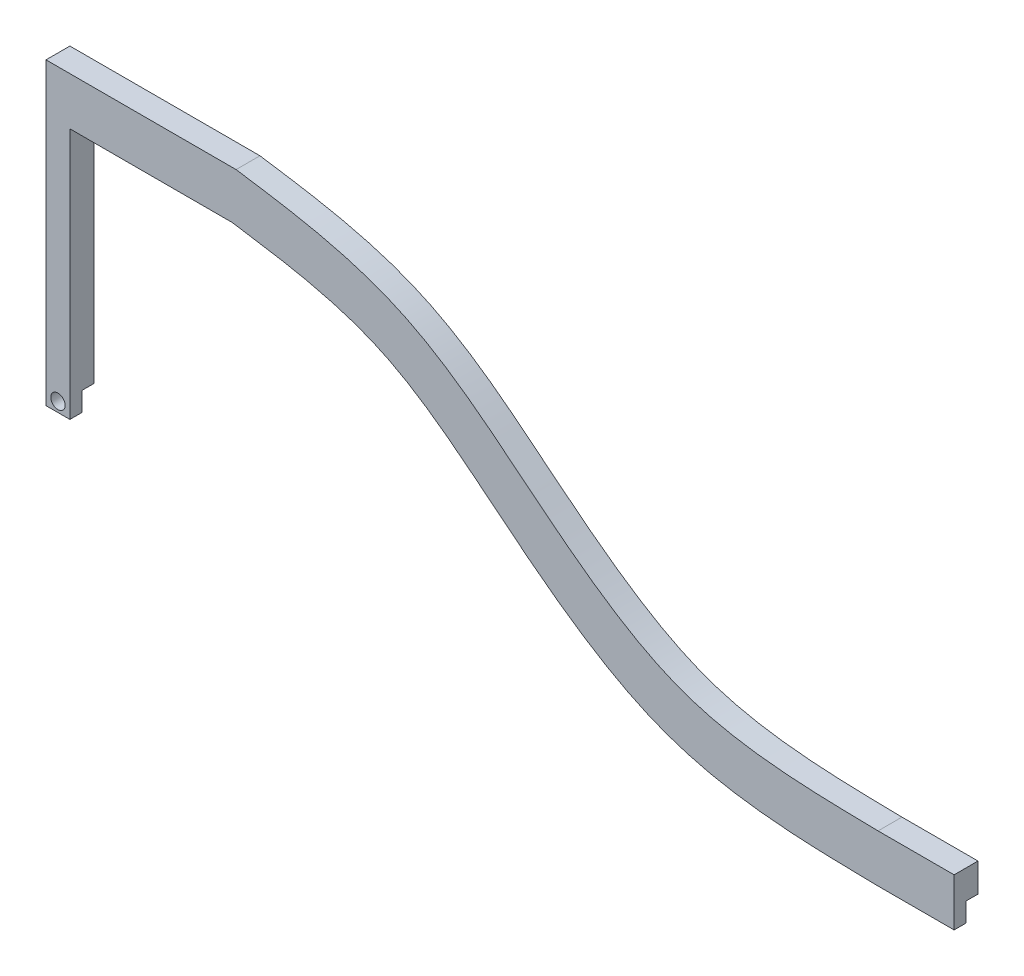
ISO-10303-21;
HEADER;
FILE_DESCRIPTION(('STEP AP214'),'2;1');
FILE_NAME('part.step','',(''),(''),'','','');
FILE_SCHEMA(('AUTOMOTIVE_DESIGN { 1 0 10303 214 1 1 1 1 }'));
ENDSEC;
DATA;
#1=APPLICATION_CONTEXT('core data for automotive mechanical design processes');
#2=APPLICATION_PROTOCOL_DEFINITION('international standard','automotive_design',2000,#1);
#3=PRODUCT_CONTEXT('',#1,'mechanical');
#4=PRODUCT('Part','Part','',(#3));
#5=PRODUCT_RELATED_PRODUCT_CATEGORY('part','',(#4));
#6=PRODUCT_DEFINITION_FORMATION('','',#4);
#7=PRODUCT_DEFINITION_CONTEXT('part definition',#1,'design');
#8=PRODUCT_DEFINITION('design','',#6,#7);
#9=PRODUCT_DEFINITION_SHAPE('','',#8);
#10=(LENGTH_UNIT() NAMED_UNIT(*) SI_UNIT(.MILLI.,.METRE.));
#11=(NAMED_UNIT(*) PLANE_ANGLE_UNIT() SI_UNIT($,.RADIAN.));
#12=(NAMED_UNIT(*) SI_UNIT($,.STERADIAN.) SOLID_ANGLE_UNIT());
#13=UNCERTAINTY_MEASURE_WITH_UNIT(LENGTH_MEASURE(1.E-05),#10,'distance_accuracy_value','');
#14=(GEOMETRIC_REPRESENTATION_CONTEXT(3) GLOBAL_UNCERTAINTY_ASSIGNED_CONTEXT((#13)) GLOBAL_UNIT_ASSIGNED_CONTEXT((#10,
#11,#12)) REPRESENTATION_CONTEXT('',''));
#15=CARTESIAN_POINT('',(0.,0.,0.));
#16=DIRECTION('',(0.,0.,1.));
#17=DIRECTION('',(1.,0.,0.));
#18=AXIS2_PLACEMENT_3D('',#15,#16,#17);
#19=CARTESIAN_POINT('',(0.,15.922114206,1.27));
#20=DIRECTION('',(0.,1.,0.));
#21=DIRECTION('',(0.,0.,1.));
#22=AXIS2_PLACEMENT_3D('',#19,#20,#21);
#23=PLANE('',#22);
#24=DIRECTION('',(1.,0.,0.));
#25=VECTOR('',#24,1.);
#26=CARTESIAN_POINT('',(0.,15.922114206,0.));
#27=LINE('',#26,#25);
#28=CARTESIAN_POINT('',(-1.27,15.922114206,0.));
#29=VERTEX_POINT('',#28);
#30=CARTESIAN_POINT('',(8.83455771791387,15.922114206,0.));
#31=VERTEX_POINT('',#30);
#32=EDGE_CURVE('E224',#29,#31,#27,.T.);
#33=ORIENTED_EDGE('',*,*,#32,.F.);
#34=DIRECTION('',(0.,0.,-1.));
#35=VECTOR('',#34,1.);
#36=CARTESIAN_POINT('',(-1.27,15.922114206,67.9279261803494));
#37=LINE('',#36,#35);
#38=CARTESIAN_POINT('',(-1.27,15.922114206,1.26999999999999));
#39=VERTEX_POINT('',#38);
#40=EDGE_CURVE('E171',#39,#29,#37,.T.);
#41=ORIENTED_EDGE('',*,*,#40,.F.);
#42=DIRECTION('',(1.,0.,0.));
#43=VECTOR('',#42,1.);
#44=CARTESIAN_POINT('',(0.,15.922114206,1.27));
#45=LINE('',#44,#43);
#46=CARTESIAN_POINT('',(8.83455771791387,15.922114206,1.27));
#47=VERTEX_POINT('',#46);
#48=EDGE_CURVE('E192',#39,#47,#45,.T.);
#49=ORIENTED_EDGE('',*,*,#48,.T.);
#50=DIRECTION('',(0.,0.,-1.));
#51=VECTOR('',#50,1.);
#52=CARTESIAN_POINT('',(8.83455771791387,15.922114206,1.27));
#53=LINE('',#52,#51);
#54=EDGE_CURVE('E227',#47,#31,#53,.T.);
#55=ORIENTED_EDGE('',*,*,#54,.T.);
#56=EDGE_LOOP('',(#33,#41,#49,#55));
#57=FACE_BOUND('',#56,.T.);
#58=ADVANCED_FACE('F31',(#57),#23,.T.);
#59=CARTESIAN_POINT('',(0.,0.,1.27));
#60=DIRECTION('',(0.,-1.,0.));
#61=DIRECTION('',(0.,0.,-1.));
#62=AXIS2_PLACEMENT_3D('',#59,#60,#61);
#63=PLANE('',#62);
#64=DIRECTION('',(-1.,0.,0.));
#65=VECTOR('',#64,1.);
#66=CARTESIAN_POINT('',(65.1488690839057,0.,0.635));
#67=LINE('',#66,#65);
#68=CARTESIAN_POINT('',(0.,0.,0.635));
#69=VERTEX_POINT('',#68);
#70=CARTESIAN_POINT('',(-1.27,0.,0.634999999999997));
#71=VERTEX_POINT('',#70);
#72=EDGE_CURVE('E54',#69,#71,#67,.T.);
#73=ORIENTED_EDGE('',*,*,#72,.F.);
#74=DIRECTION('',(0.,0.,-1.));
#75=VECTOR('',#74,1.);
#76=CARTESIAN_POINT('',(0.,0.,1.27));
#77=LINE('',#76,#75);
#78=CARTESIAN_POINT('',(0.,0.,1.27));
#79=VERTEX_POINT('',#78);
#80=EDGE_CURVE('E260',#79,#69,#77,.T.);
#81=ORIENTED_EDGE('',*,*,#80,.F.);
#82=DIRECTION('',(-1.,0.,0.));
#83=VECTOR('',#82,1.);
#84=CARTESIAN_POINT('',(0.,0.,1.27));
#85=LINE('',#84,#83);
#86=CARTESIAN_POINT('',(-1.27,0.,1.26999999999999));
#87=VERTEX_POINT('',#86);
#88=EDGE_CURVE('E337',#79,#87,#85,.T.);
#89=ORIENTED_EDGE('',*,*,#88,.T.);
#90=DIRECTION('',(0.,0.,-1.));
#91=VECTOR('',#90,1.);
#92=CARTESIAN_POINT('',(-1.27,0.,67.9279261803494));
#93=LINE('',#92,#91);
#94=EDGE_CURVE('E170',#87,#71,#93,.T.);
#95=ORIENTED_EDGE('',*,*,#94,.T.);
#96=EDGE_LOOP('',(#73,#81,#89,#95));
#97=FACE_BOUND('',#96,.T.);
#98=ADVANCED_FACE('F215',(#97),#63,.T.);
#99=CARTESIAN_POINT('',(26.7020393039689,7.21110102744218,1.27));
#100=DIRECTION('',(0.,0.,-1.));
#101=DIRECTION('',(-1.,0.,0.));
#102=AXIS2_PLACEMENT_3D('',#99,#100,#101);
#103=PLANE('',#102);
#104=CARTESIAN_POINT('',(-0.635,0.517047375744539,1.27));
#105=DIRECTION('',(0.,0.,1.));
#106=DIRECTION('',(1.,0.,0.));
#107=AXIS2_PLACEMENT_3D('',#104,#105,#106);
#108=CIRCLE('',#107,0.381);
#109=CARTESIAN_POINT('',(-0.254,0.517047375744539,1.27));
#110=VERTEX_POINT('',#109);
#111=EDGE_CURVE('E143',#110,#110,#108,.T.);
#112=ORIENTED_EDGE('',*,*,#111,.F.);
#113=EDGE_LOOP('',(#112));
#114=FACE_BOUND('',#113,.T.);
#115=DIRECTION('',(0.,1.,0.));
#116=VECTOR('',#115,1.);
#117=CARTESIAN_POINT('',(-1.27,7.21110102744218,1.27));
#118=LINE('',#117,#116);
#119=EDGE_CURVE('E174',#87,#39,#118,.T.);
#120=ORIENTED_EDGE('',*,*,#119,.F.);
#121=ORIENTED_EDGE('',*,*,#88,.F.);
#122=DIRECTION('',(0.,1.,0.));
#123=VECTOR('',#122,1.);
#124=CARTESIAN_POINT('',(0.,0.,1.27));
#125=LINE('',#124,#123);
#126=CARTESIAN_POINT('',(0.,13.382114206,1.27));
#127=VERTEX_POINT('',#126);
#128=EDGE_CURVE('E296',#79,#127,#125,.T.);
#129=ORIENTED_EDGE('',*,*,#128,.T.);
#130=DIRECTION('',(1.,0.,0.));
#131=VECTOR('',#130,1.);
#132=CARTESIAN_POINT('',(0.,13.382114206,1.27));
#133=LINE('',#132,#131);
#134=CARTESIAN_POINT('',(8.64245458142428,13.382114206,1.27));
#135=VERTEX_POINT('',#134);
#136=EDGE_CURVE('E293',#127,#135,#133,.T.);
#137=ORIENTED_EDGE('',*,*,#136,.T.);
#138=CARTESIAN_POINT('',(8.64245458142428,13.382114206,1.27));
#139=CARTESIAN_POINT('',(11.3837031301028,12.9650811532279,1.27));
#140=CARTESIAN_POINT('',(16.6168440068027,12.1689502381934,1.27));
#141=CARTESIAN_POINT('',(23.466093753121,6.44904374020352,1.27));
#142=CARTESIAN_POINT('',(31.478990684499,0.189830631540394,1.27));
#143=CARTESIAN_POINT('',(39.0643321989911,0.0642075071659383,1.27));
#144=CARTESIAN_POINT('',(42.9412925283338,0.,1.27));
#145=B_SPLINE_CURVE_WITH_KNOTS('',3,(#138,#139,#140,#141,#142,#143,#144),.UNSPECIFIED.,.F.,.F.,
(4,1,1,1,4),(0.,0.216097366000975,0.412537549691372,0.699740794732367,1.),.UNSPECIFIED.);
#146=CARTESIAN_POINT('',(42.9412925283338,0.,1.27));
#147=VERTEX_POINT('',#146);
#148=EDGE_CURVE('E254',#135,#147,#145,.T.);
#149=ORIENTED_EDGE('',*,*,#148,.T.);
#150=DIRECTION('',(1.,0.,0.));
#151=VECTOR('',#150,1.);
#152=CARTESIAN_POINT('',(42.9412925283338,0.,1.27));
#153=LINE('',#152,#151);
#154=CARTESIAN_POINT('',(47.0052925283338,0.,1.27));
#155=VERTEX_POINT('',#154);
#156=EDGE_CURVE('E178',#147,#155,#153,.T.);
#157=ORIENTED_EDGE('',*,*,#156,.T.);
#158=DIRECTION('',(0.,-1.,0.));
#159=VECTOR('',#158,1.);
#160=CARTESIAN_POINT('',(47.0052925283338,2.54,1.27));
#161=LINE('',#160,#159);
#162=CARTESIAN_POINT('',(47.0052925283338,2.54,1.27));
#163=VERTEX_POINT('',#162);
#164=EDGE_CURVE('E180',#163,#155,#161,.T.);
#165=ORIENTED_EDGE('',*,*,#164,.F.);
#166=DIRECTION('',(1.,0.,0.));
#167=VECTOR('',#166,1.);
#168=CARTESIAN_POINT('',(42.9412925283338,2.54,1.27));
#169=LINE('',#168,#167);
#170=CARTESIAN_POINT('',(42.9623243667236,2.54,1.27));
#171=VERTEX_POINT('',#170);
#172=EDGE_CURVE('E183',#171,#163,#169,.T.);
#173=ORIENTED_EDGE('',*,*,#172,.F.);
#174=CARTESIAN_POINT('',(8.83455771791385,15.922114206,1.27));
#175=CARTESIAN_POINT('',(9.23273478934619,15.8615385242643,1.27));
#176=CARTESIAN_POINT('',(9.63311586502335,15.8009005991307,1.27));
#177=CARTESIAN_POINT('',(10.4441054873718,15.6741757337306,1.27));
#178=CARTESIAN_POINT('',(10.8535402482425,15.6082191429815,1.27));
#179=CARTESIAN_POINT('',(12.0908968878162,15.3953394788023,1.27));
#180=CARTESIAN_POINT('',(12.9279317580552,15.2336201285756,1.27));
#181=CARTESIAN_POINT('',(14.6114985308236,14.8272292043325,1.27));
#182=CARTESIAN_POINT('',(15.4583285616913,14.5824900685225,1.27));
#183=CARTESIAN_POINT('',(16.7207698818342,14.115925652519,1.27));
#184=CARTESIAN_POINT('',(17.1402076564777,13.9437798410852,1.27));
#185=CARTESIAN_POINT('',(17.9724186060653,13.5599427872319,1.27));
#186=CARTESIAN_POINT('',(18.3764903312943,13.3519568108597,1.27));
#187=CARTESIAN_POINT('',(19.5491715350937,12.6952136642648,1.27));
#188=CARTESIAN_POINT('',(20.2815702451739,12.2126050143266,1.27));
#189=CARTESIAN_POINT('',(21.677061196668,11.2109690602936,1.27));
#190=CARTESIAN_POINT('',(22.3404330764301,10.6917151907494,1.27));
#191=CARTESIAN_POINT('',(23.6255901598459,9.65963581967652,1.27));
#192=CARTESIAN_POINT('',(24.2449733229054,9.14974524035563,1.27));
#193=CARTESIAN_POINT('',(25.4784794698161,8.1566812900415,1.27));
#194=CARTESIAN_POINT('',(26.0912160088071,7.67245835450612,1.27));
#195=CARTESIAN_POINT('',(27.9236858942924,6.28838637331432,1.27));
#196=CARTESIAN_POINT('',(29.1380165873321,5.45869430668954,1.27));
#197=CARTESIAN_POINT('',(30.9601431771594,4.46366236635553,1.27));
#198=CARTESIAN_POINT('',(31.5674093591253,4.17321837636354,1.27));
#199=CARTESIAN_POINT('',(32.481150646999,3.8087078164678,1.27));
#200=CARTESIAN_POINT('',(32.7851437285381,3.69964034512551,1.27));
#201=CARTESIAN_POINT('',(33.4102256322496,3.49948761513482,1.27));
#202=CARTESIAN_POINT('',(33.7295545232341,3.40886505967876,1.27));
#203=CARTESIAN_POINT('',(35.3598925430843,2.99892132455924,1.27));
#204=CARTESIAN_POINT('',(36.7742000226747,2.81059923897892,1.27));
#205=CARTESIAN_POINT('',(39.7660493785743,2.59467989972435,1.27));
#206=CARTESIAN_POINT('',(41.3415368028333,2.56684399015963,1.27));
#207=CARTESIAN_POINT('',(42.9623243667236,2.54,1.27));
#208=B_SPLINE_CURVE_WITH_KNOTS('',3,(#174,#175,#176,#177,#178,#179,#180,#181,#182,#183,#184,
#185,#186,#187,#188,#189,#190,#191,#192,#193,#194,#195,#196,#197,#198,#199,#200,#201,#202,#203,
#204,#205,#206,#207),.UNSPECIFIED.,.F.,.F.,(4,2,2,2,2,2,2,2,2,2,2,2,2,2,2,2,4),(0.,
0.0312499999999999,0.0624999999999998,0.125,0.1875,0.21875,0.25,0.3125,0.375,0.4375,0.5,0.625,
0.6875,0.71875,0.750000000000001,0.875,1.),.UNSPECIFIED.);
#209=EDGE_CURVE('E186',#47,#171,#208,.T.);
#210=ORIENTED_EDGE('',*,*,#209,.F.);
#211=ORIENTED_EDGE('',*,*,#48,.F.);
#212=EDGE_LOOP('',(#120,#121,#129,#137,#149,#157,#165,#173,#210,#211));
#213=FACE_BOUND('',#212,.T.);
#214=ADVANCED_FACE('F220',(#114,#213),#103,.F.);
#215=CARTESIAN_POINT('',(26.7020393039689,7.21110102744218,0.));
#216=DIRECTION('',(0.,0.,-1.));
#217=DIRECTION('',(-1.,0.,0.));
#218=AXIS2_PLACEMENT_3D('',#215,#216,#217);
#219=PLANE('',#218);
#220=DIRECTION('',(-1.,0.,0.));
#221=VECTOR('',#220,1.);
#222=CARTESIAN_POINT('',(65.1488690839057,1.016,0.));
#223=LINE('',#222,#221);
#224=CARTESIAN_POINT('',(0.,1.016,0.));
#225=VERTEX_POINT('',#224);
#226=CARTESIAN_POINT('',(-1.26999999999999,1.016,0.));
#227=VERTEX_POINT('',#226);
#228=EDGE_CURVE('E153',#225,#227,#223,.T.);
#229=ORIENTED_EDGE('',*,*,#228,.T.);
#230=DIRECTION('',(0.,1.,0.));
#231=VECTOR('',#230,1.);
#232=CARTESIAN_POINT('',(-1.27,7.21110102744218,0.));
#233=LINE('',#232,#231);
#234=EDGE_CURVE('E39',#227,#29,#233,.T.);
#235=ORIENTED_EDGE('',*,*,#234,.T.);
#236=ORIENTED_EDGE('',*,*,#32,.T.);
#237=CARTESIAN_POINT('',(8.83455771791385,15.922114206,0.));
#238=CARTESIAN_POINT('',(9.23273478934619,15.8615385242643,0.));
#239=CARTESIAN_POINT('',(9.63311586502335,15.8009005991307,0.));
#240=CARTESIAN_POINT('',(10.4441054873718,15.6741757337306,0.));
#241=CARTESIAN_POINT('',(10.8535402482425,15.6082191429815,0.));
#242=CARTESIAN_POINT('',(12.0908968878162,15.3953394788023,0.));
#243=CARTESIAN_POINT('',(12.9279317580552,15.2336201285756,0.));
#244=CARTESIAN_POINT('',(14.6114985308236,14.8272292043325,0.));
#245=CARTESIAN_POINT('',(15.4583285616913,14.5824900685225,0.));
#246=CARTESIAN_POINT('',(16.7207698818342,14.115925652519,0.));
#247=CARTESIAN_POINT('',(17.1402076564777,13.9437798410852,0.));
#248=CARTESIAN_POINT('',(17.9724186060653,13.5599427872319,0.));
#249=CARTESIAN_POINT('',(18.3764903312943,13.3519568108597,0.));
#250=CARTESIAN_POINT('',(19.5491715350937,12.6952136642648,0.));
#251=CARTESIAN_POINT('',(20.2815702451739,12.2126050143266,0.));
#252=CARTESIAN_POINT('',(21.677061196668,11.2109690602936,0.));
#253=CARTESIAN_POINT('',(22.3404330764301,10.6917151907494,0.));
#254=CARTESIAN_POINT('',(23.6255901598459,9.65963581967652,0.));
#255=CARTESIAN_POINT('',(24.2449733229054,9.14974524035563,0.));
#256=CARTESIAN_POINT('',(25.4784794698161,8.1566812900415,0.));
#257=CARTESIAN_POINT('',(26.0912160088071,7.67245835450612,0.));
#258=CARTESIAN_POINT('',(27.9236858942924,6.28838637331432,0.));
#259=CARTESIAN_POINT('',(29.1380165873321,5.45869430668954,0.));
#260=CARTESIAN_POINT('',(30.9601431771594,4.46366236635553,0.));
#261=CARTESIAN_POINT('',(31.5674093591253,4.17321837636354,0.));
#262=CARTESIAN_POINT('',(32.481150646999,3.8087078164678,0.));
#263=CARTESIAN_POINT('',(32.7851437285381,3.69964034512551,0.));
#264=CARTESIAN_POINT('',(33.4102256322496,3.49948761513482,0.));
#265=CARTESIAN_POINT('',(33.7295545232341,3.40886505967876,0.));
#266=CARTESIAN_POINT('',(35.3598925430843,2.99892132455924,0.));
#267=CARTESIAN_POINT('',(36.7742000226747,2.81059923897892,0.));
#268=CARTESIAN_POINT('',(39.7660493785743,2.59467989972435,0.));
#269=CARTESIAN_POINT('',(41.3415368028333,2.56684399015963,0.));
#270=CARTESIAN_POINT('',(42.9623243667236,2.54,0.));
#271=B_SPLINE_CURVE_WITH_KNOTS('',3,(#237,#238,#239,#240,#241,#242,#243,#244,#245,#246,#247,
#248,#249,#250,#251,#252,#253,#254,#255,#256,#257,#258,#259,#260,#261,#262,#263,#264,#265,#266,
#267,#268,#269,#270),.UNSPECIFIED.,.F.,.F.,(4,2,2,2,2,2,2,2,2,2,2,2,2,2,2,2,4),(0.,
0.0312499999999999,0.0624999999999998,0.125,0.1875,0.21875,0.25,0.3125,0.375,0.4375,0.5,0.625,
0.6875,0.71875,0.750000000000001,0.875,1.),.UNSPECIFIED.);
#272=CARTESIAN_POINT('',(42.9623243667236,2.54,0.));
#273=VERTEX_POINT('',#272);
#274=EDGE_CURVE('E232',#31,#273,#271,.T.);
#275=ORIENTED_EDGE('',*,*,#274,.T.);
#276=DIRECTION('',(1.,0.,0.));
#277=VECTOR('',#276,1.);
#278=CARTESIAN_POINT('',(42.9412925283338,2.54,0.));
#279=LINE('',#278,#277);
#280=CARTESIAN_POINT('',(47.0052925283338,2.54,0.));
#281=VERTEX_POINT('',#280);
#282=EDGE_CURVE('E236',#273,#281,#279,.T.);
#283=ORIENTED_EDGE('',*,*,#282,.T.);
#284=DIRECTION('',(0.,-1.,0.));
#285=VECTOR('',#284,1.);
#286=CARTESIAN_POINT('',(47.0052925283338,2.54,0.));
#287=LINE('',#286,#285);
#288=CARTESIAN_POINT('',(47.0052925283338,1.016,0.));
#289=VERTEX_POINT('',#288);
#290=EDGE_CURVE('E177',#281,#289,#287,.T.);
#291=ORIENTED_EDGE('',*,*,#290,.T.);
#292=CARTESIAN_POINT('',(32.867344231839,1.016,0.));
#293=VERTEX_POINT('',#292);
#294=EDGE_CURVE('E138',#289,#293,#223,.T.);
#295=ORIENTED_EDGE('',*,*,#294,.T.);
#296=CARTESIAN_POINT('',(8.64245458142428,13.382114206,0.));
#297=CARTESIAN_POINT('',(11.3837031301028,12.9650811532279,0.));
#298=CARTESIAN_POINT('',(16.6168440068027,12.1689502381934,0.));
#299=CARTESIAN_POINT('',(23.466093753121,6.44904374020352,0.));
#300=CARTESIAN_POINT('',(31.478990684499,0.189830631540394,0.));
#301=CARTESIAN_POINT('',(39.0643321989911,0.0642075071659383,0.));
#302=CARTESIAN_POINT('',(42.9412925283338,0.,0.));
#303=B_SPLINE_CURVE_WITH_KNOTS('',3,(#296,#297,#298,#299,#300,#301,#302),.UNSPECIFIED.,.F.,.F.,
(4,1,1,1,4),(0.,0.216097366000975,0.412537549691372,0.699740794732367,1.),.UNSPECIFIED.);
#304=CARTESIAN_POINT('',(8.64245458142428,13.382114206,0.));
#305=VERTEX_POINT('',#304);
#306=EDGE_CURVE('E181',#305,#293,#303,.T.);
#307=ORIENTED_EDGE('',*,*,#306,.F.);
#308=DIRECTION('',(1.,0.,0.));
#309=VECTOR('',#308,1.);
#310=CARTESIAN_POINT('',(0.,13.382114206,0.));
#311=LINE('',#310,#309);
#312=CARTESIAN_POINT('',(0.,13.382114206,0.));
#313=VERTEX_POINT('',#312);
#314=EDGE_CURVE('E234',#313,#305,#311,.T.);
#315=ORIENTED_EDGE('',*,*,#314,.F.);
#316=DIRECTION('',(0.,1.,0.));
#317=VECTOR('',#316,1.);
#318=CARTESIAN_POINT('',(0.,0.,0.));
#319=LINE('',#318,#317);
#320=EDGE_CURVE('E231',#225,#313,#319,.T.);
#321=ORIENTED_EDGE('',*,*,#320,.F.);
#322=EDGE_LOOP('',(#229,#235,#236,#275,#283,#291,#295,#307,#315,#321));
#323=FACE_BOUND('',#322,.T.);
#324=ADVANCED_FACE('F212',(#323),#219,.T.);
#325=CARTESIAN_POINT('',(42.9412925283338,0.,1.27));
#326=DIRECTION('',(0.,1.,0.));
#327=DIRECTION('',(0.,0.,1.));
#328=AXIS2_PLACEMENT_3D('',#325,#326,#327);
#329=PLANE('',#328);
#330=DIRECTION('',(0.,0.,-1.));
#331=VECTOR('',#330,1.);
#332=CARTESIAN_POINT('',(42.9412925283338,0.,1.27));
#333=LINE('',#332,#331);
#334=CARTESIAN_POINT('',(42.9412925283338,0.,0.635));
#335=VERTEX_POINT('',#334);
#336=EDGE_CURVE('E247',#147,#335,#333,.T.);
#337=ORIENTED_EDGE('',*,*,#336,.T.);
#338=CARTESIAN_POINT('',(47.0052925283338,0.,0.635));
#339=VERTEX_POINT('',#338);
#340=EDGE_CURVE('E271',#339,#335,#67,.T.);
#341=ORIENTED_EDGE('',*,*,#340,.F.);
#342=DIRECTION('',(0.,0.,-1.));
#343=VECTOR('',#342,1.);
#344=CARTESIAN_POINT('',(47.0052925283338,0.,1.27));
#345=LINE('',#344,#343);
#346=EDGE_CURVE('E160',#155,#339,#345,.T.);
#347=ORIENTED_EDGE('',*,*,#346,.F.);
#348=ORIENTED_EDGE('',*,*,#156,.F.);
#349=EDGE_LOOP('',(#337,#341,#347,#348));
#350=FACE_BOUND('',#349,.T.);
#351=ADVANCED_FACE('F33',(#350),#329,.F.);
#352=CARTESIAN_POINT('',(47.0052925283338,2.54,1.27));
#353=DIRECTION('',(1.,0.,0.));
#354=DIRECTION('',(0.,0.,-1.));
#355=AXIS2_PLACEMENT_3D('',#352,#353,#354);
#356=PLANE('',#355);
#357=DIRECTION('',(0.,-1.,0.));
#358=VECTOR('',#357,1.);
#359=CARTESIAN_POINT('',(47.0052925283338,2.54,0.635));
#360=LINE('',#359,#358);
#361=CARTESIAN_POINT('',(47.0052925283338,1.016,0.635));
#362=VERTEX_POINT('',#361);
#363=EDGE_CURVE('E148',#362,#339,#360,.T.);
#364=ORIENTED_EDGE('',*,*,#363,.F.);
#365=DIRECTION('',(0.,0.,1.));
#366=VECTOR('',#365,1.);
#367=CARTESIAN_POINT('',(47.0052925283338,1.016,1.27));
#368=LINE('',#367,#366);
#369=EDGE_CURVE('E132',#289,#362,#368,.T.);
#370=ORIENTED_EDGE('',*,*,#369,.F.);
#371=ORIENTED_EDGE('',*,*,#290,.F.);
#372=DIRECTION('',(0.,0.,-1.));
#373=VECTOR('',#372,1.);
#374=CARTESIAN_POINT('',(47.0052925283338,2.54,1.27));
#375=LINE('',#374,#373);
#376=EDGE_CURVE('E265',#163,#281,#375,.T.);
#377=ORIENTED_EDGE('',*,*,#376,.F.);
#378=ORIENTED_EDGE('',*,*,#164,.T.);
#379=ORIENTED_EDGE('',*,*,#346,.T.);
#380=EDGE_LOOP('',(#364,#370,#371,#377,#378,#379));
#381=FACE_BOUND('',#380,.T.);
#382=ADVANCED_FACE('F157',(#381),#356,.T.);
#383=CARTESIAN_POINT('',(42.9412925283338,2.54,1.27));
#384=DIRECTION('',(0.,1.,0.));
#385=DIRECTION('',(0.,0.,1.));
#386=AXIS2_PLACEMENT_3D('',#383,#384,#385);
#387=PLANE('',#386);
#388=ORIENTED_EDGE('',*,*,#282,.F.);
#389=DIRECTION('',(0.,0.,-1.));
#390=VECTOR('',#389,1.);
#391=CARTESIAN_POINT('',(42.9623243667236,2.54,1.27));
#392=LINE('',#391,#390);
#393=EDGE_CURVE('E263',#171,#273,#392,.T.);
#394=ORIENTED_EDGE('',*,*,#393,.F.);
#395=ORIENTED_EDGE('',*,*,#172,.T.);
#396=ORIENTED_EDGE('',*,*,#376,.T.);
#397=EDGE_LOOP('',(#388,#394,#395,#396));
#398=FACE_BOUND('',#397,.T.);
#399=ADVANCED_FACE('F203',(#398),#387,.T.);
#400=DIRECTION('',(0.,0.,-1.));
#401=VECTOR('',#400,1.);
#402=SURFACE_OF_LINEAR_EXTRUSION('',#208,#401);
#403=ORIENTED_EDGE('',*,*,#274,.F.);
#404=ORIENTED_EDGE('',*,*,#54,.F.);
#405=ORIENTED_EDGE('',*,*,#209,.T.);
#406=ORIENTED_EDGE('',*,*,#393,.T.);
#407=EDGE_LOOP('',(#403,#404,#405,#406));
#408=FACE_BOUND('',#407,.T.);
#409=ADVANCED_FACE('F198',(#408),#402,.T.);
#410=CARTESIAN_POINT('',(0.,0.,1.27));
#411=DIRECTION('',(-1.,0.,0.));
#412=DIRECTION('',(0.,0.,1.));
#413=AXIS2_PLACEMENT_3D('',#410,#411,#412);
#414=PLANE('',#413);
#415=ORIENTED_EDGE('',*,*,#80,.T.);
#416=DIRECTION('',(0.,1.,0.));
#417=VECTOR('',#416,1.);
#418=CARTESIAN_POINT('',(0.,0.,0.635));
#419=LINE('',#418,#417);
#420=CARTESIAN_POINT('',(0.,1.016,0.635));
#421=VERTEX_POINT('',#420);
#422=EDGE_CURVE('E46',#69,#421,#419,.T.);
#423=ORIENTED_EDGE('',*,*,#422,.T.);
#424=DIRECTION('',(0.,0.,-1.));
#425=VECTOR('',#424,1.);
#426=CARTESIAN_POINT('',(0.,1.016,1.27));
#427=LINE('',#426,#425);
#428=EDGE_CURVE('E144',#421,#225,#427,.T.);
#429=ORIENTED_EDGE('',*,*,#428,.T.);
#430=ORIENTED_EDGE('',*,*,#320,.T.);
#431=DIRECTION('',(0.,0.,-1.));
#432=VECTOR('',#431,1.);
#433=CARTESIAN_POINT('',(0.,13.382114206,1.27));
#434=LINE('',#433,#432);
#435=EDGE_CURVE('E257',#127,#313,#434,.T.);
#436=ORIENTED_EDGE('',*,*,#435,.F.);
#437=ORIENTED_EDGE('',*,*,#128,.F.);
#438=EDGE_LOOP('',(#415,#423,#429,#430,#436,#437));
#439=FACE_BOUND('',#438,.T.);
#440=ADVANCED_FACE('F202',(#439),#414,.F.);
#441=CARTESIAN_POINT('',(0.,13.382114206,1.27));
#442=DIRECTION('',(0.,1.,0.));
#443=DIRECTION('',(0.,0.,1.));
#444=AXIS2_PLACEMENT_3D('',#441,#442,#443);
#445=PLANE('',#444);
#446=ORIENTED_EDGE('',*,*,#314,.T.);
#447=DIRECTION('',(0.,0.,-1.));
#448=VECTOR('',#447,1.);
#449=CARTESIAN_POINT('',(8.64245458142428,13.382114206,1.27));
#450=LINE('',#449,#448);
#451=EDGE_CURVE('E253',#135,#305,#450,.T.);
#452=ORIENTED_EDGE('',*,*,#451,.F.);
#453=ORIENTED_EDGE('',*,*,#136,.F.);
#454=ORIENTED_EDGE('',*,*,#435,.T.);
#455=EDGE_LOOP('',(#446,#452,#453,#454));
#456=FACE_BOUND('',#455,.T.);
#457=ADVANCED_FACE('F311',(#456),#445,.F.);
#458=DIRECTION('',(0.,0.,-1.));
#459=VECTOR('',#458,1.);
#460=SURFACE_OF_LINEAR_EXTRUSION('',#145,#459);
#461=DIRECTION('',(0.,0.,-1.));
#462=VECTOR('',#461,1.);
#463=CARTESIAN_POINT('',(32.867344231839,1.016,1.27));
#464=LINE('',#463,#462);
#465=CARTESIAN_POINT('',(32.867344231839,1.016,0.635));
#466=VERTEX_POINT('',#465);
#467=EDGE_CURVE('E161',#293,#466,#464,.F.);
#468=ORIENTED_EDGE('',*,*,#467,.T.);
#469=CARTESIAN_POINT('',(8.64245458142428,13.382114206,0.635));
#470=CARTESIAN_POINT('',(11.3837031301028,12.9650811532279,0.635));
#471=CARTESIAN_POINT('',(16.6168440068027,12.1689502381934,0.635));
#472=CARTESIAN_POINT('',(23.466093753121,6.44904374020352,0.635));
#473=CARTESIAN_POINT('',(31.478990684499,0.189830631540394,0.635));
#474=CARTESIAN_POINT('',(39.0643321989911,0.0642075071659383,0.635));
#475=CARTESIAN_POINT('',(42.9412925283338,0.,0.635));
#476=B_SPLINE_CURVE_WITH_KNOTS('',3,(#469,#470,#471,#472,#473,#474,#475),.UNSPECIFIED.,.F.,.F.,
(4,1,1,1,4),(0.,0.216097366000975,0.412537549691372,0.699740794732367,1.),.UNSPECIFIED.);
#477=EDGE_CURVE('E151',#466,#335,#476,.T.);
#478=ORIENTED_EDGE('',*,*,#477,.T.);
#479=ORIENTED_EDGE('',*,*,#336,.F.);
#480=ORIENTED_EDGE('',*,*,#148,.F.);
#481=ORIENTED_EDGE('',*,*,#451,.T.);
#482=ORIENTED_EDGE('',*,*,#306,.T.);
#483=EDGE_LOOP('',(#468,#478,#479,#480,#481,#482));
#484=FACE_BOUND('',#483,.T.);
#485=ADVANCED_FACE('F285',(#484),#460,.F.);
#486=CARTESIAN_POINT('',(-1.27,0.,67.9279261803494));
#487=DIRECTION('',(-1.,0.,0.));
#488=DIRECTION('',(0.,0.,1.));
#489=AXIS2_PLACEMENT_3D('',#486,#487,#488);
#490=PLANE('',#489);
#491=DIRECTION('',(0.,1.,0.));
#492=VECTOR('',#491,1.);
#493=CARTESIAN_POINT('',(-1.27,0.,0.634999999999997));
#494=LINE('',#493,#492);
#495=CARTESIAN_POINT('',(-1.27,1.016,0.634999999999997));
#496=VERTEX_POINT('',#495);
#497=EDGE_CURVE('E270',#71,#496,#494,.T.);
#498=ORIENTED_EDGE('',*,*,#497,.F.);
#499=ORIENTED_EDGE('',*,*,#94,.F.);
#500=ORIENTED_EDGE('',*,*,#119,.T.);
#501=ORIENTED_EDGE('',*,*,#40,.T.);
#502=ORIENTED_EDGE('',*,*,#234,.F.);
#503=DIRECTION('',(0.,0.,-1.));
#504=VECTOR('',#503,1.);
#505=CARTESIAN_POINT('',(-1.27,1.016,67.9279261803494));
#506=LINE('',#505,#504);
#507=EDGE_CURVE('E11',#496,#227,#506,.T.);
#508=ORIENTED_EDGE('',*,*,#507,.F.);
#509=EDGE_LOOP('',(#498,#499,#500,#501,#502,#508));
#510=FACE_BOUND('',#509,.T.);
#511=ADVANCED_FACE('F310',(#510),#490,.T.);
#512=CARTESIAN_POINT('',(-0.635,0.517047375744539,0.));
#513=DIRECTION('',(0.,0.,1.));
#514=DIRECTION('',(1.,0.,0.));
#515=AXIS2_PLACEMENT_3D('',#512,#513,#514);
#516=CYLINDRICAL_SURFACE('',#515,0.381);
#517=CARTESIAN_POINT('',(-0.635,0.517047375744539,0.635));
#518=DIRECTION('',(0.,0.,1.));
#519=DIRECTION('',(1.,0.,0.));
#520=AXIS2_PLACEMENT_3D('',#517,#518,#519);
#521=CIRCLE('',#520,0.381);
#522=CARTESIAN_POINT('',(-0.254,0.517047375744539,0.635));
#523=VERTEX_POINT('',#522);
#524=EDGE_CURVE('E268',#523,#523,#521,.F.);
#525=ORIENTED_EDGE('',*,*,#524,.T.);
#526=EDGE_LOOP('',(#525));
#527=FACE_BOUND('',#526,.T.);
#528=ORIENTED_EDGE('',*,*,#111,.T.);
#529=EDGE_LOOP('',(#528));
#530=FACE_BOUND('',#529,.T.);
#531=ADVANCED_FACE('F340',(#527,#530),#516,.F.);
#532=CARTESIAN_POINT('',(65.1488690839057,0.,0.635));
#533=DIRECTION('',(0.,0.,1.));
#534=DIRECTION('',(1.,0.,0.));
#535=AXIS2_PLACEMENT_3D('',#532,#533,#534);
#536=PLANE('',#535);
#537=ORIENTED_EDGE('',*,*,#524,.F.);
#538=EDGE_LOOP('',(#537));
#539=FACE_BOUND('',#538,.T.);
#540=ORIENTED_EDGE('',*,*,#422,.F.);
#541=ORIENTED_EDGE('',*,*,#72,.T.);
#542=ORIENTED_EDGE('',*,*,#497,.T.);
#543=DIRECTION('',(-1.,0.,0.));
#544=VECTOR('',#543,1.);
#545=CARTESIAN_POINT('',(65.1488690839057,1.016,0.635));
#546=LINE('',#545,#544);
#547=EDGE_CURVE('E154',#421,#496,#546,.T.);
#548=ORIENTED_EDGE('',*,*,#547,.F.);
#549=EDGE_LOOP('',(#540,#541,#542,#548));
#550=FACE_BOUND('',#549,.T.);
#551=ADVANCED_FACE('F325',(#539,#550),#536,.F.);
#552=CARTESIAN_POINT('',(65.1488690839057,1.016,0.635));
#553=DIRECTION('',(0.,1.,0.));
#554=DIRECTION('',(0.,0.,1.));
#555=AXIS2_PLACEMENT_3D('',#552,#553,#554);
#556=PLANE('',#555);
#557=ORIENTED_EDGE('',*,*,#428,.F.);
#558=ORIENTED_EDGE('',*,*,#547,.T.);
#559=ORIENTED_EDGE('',*,*,#507,.T.);
#560=ORIENTED_EDGE('',*,*,#228,.F.);
#561=EDGE_LOOP('',(#557,#558,#559,#560));
#562=FACE_BOUND('',#561,.T.);
#563=ADVANCED_FACE('F328',(#562),#556,.F.);
#564=ORIENTED_EDGE('',*,*,#294,.F.);
#565=ORIENTED_EDGE('',*,*,#369,.T.);
#566=EDGE_CURVE('E135',#362,#466,#546,.T.);
#567=ORIENTED_EDGE('',*,*,#566,.T.);
#568=ORIENTED_EDGE('',*,*,#467,.F.);
#569=EDGE_LOOP('',(#564,#565,#567,#568));
#570=FACE_BOUND('',#569,.T.);
#571=ADVANCED_FACE('F134',(#570),#556,.F.);
#572=ORIENTED_EDGE('',*,*,#566,.F.);
#573=ORIENTED_EDGE('',*,*,#363,.T.);
#574=ORIENTED_EDGE('',*,*,#340,.T.);
#575=ORIENTED_EDGE('',*,*,#477,.F.);
#576=EDGE_LOOP('',(#572,#573,#574,#575));
#577=FACE_BOUND('',#576,.T.);
#578=ADVANCED_FACE('F147',(#577),#536,.F.);
#579=CLOSED_SHELL('',(#58,#98,#214,#324,#351,#382,#399,#409,#440,#457,#485,#511,#531,#551,#563,
#571,#578));
#580=MANIFOLD_SOLID_BREP('B2',#579);
#581=ADVANCED_BREP_SHAPE_REPRESENTATION('',(#18,#580),#14);
#582=SHAPE_DEFINITION_REPRESENTATION(#9,#581);
ENDSEC;
END-ISO-10303-21;
